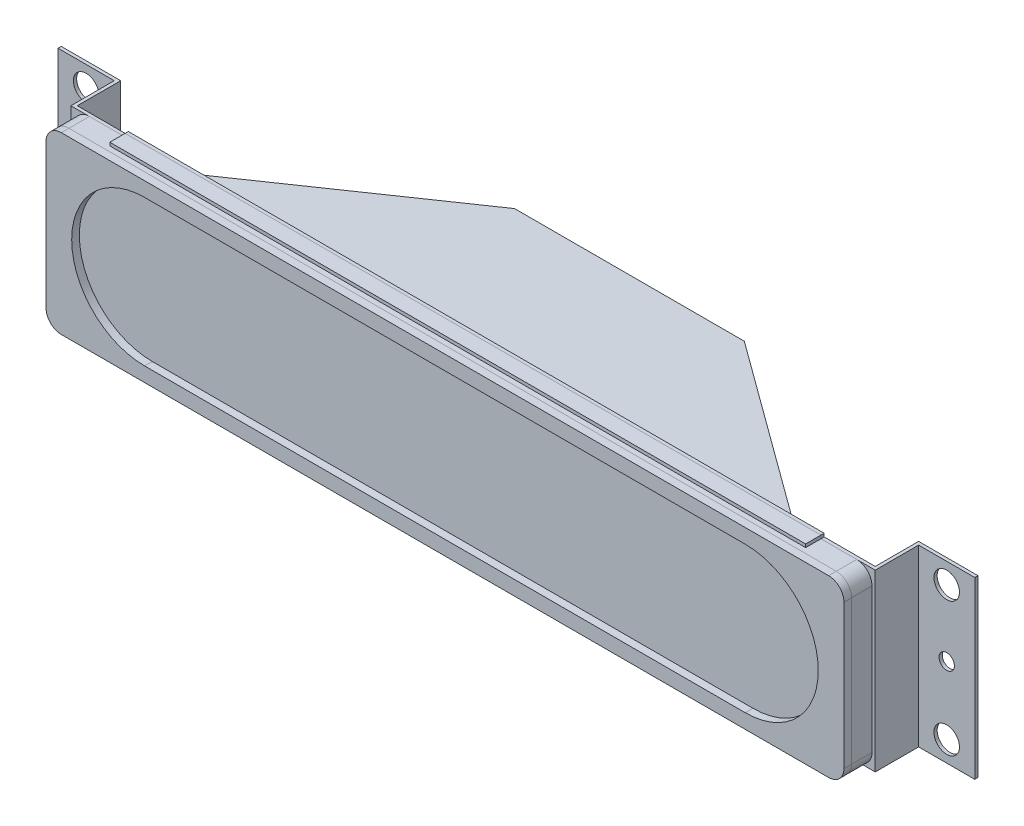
from build123d import *

# Parameters (mm, degrees)
WOOD_SURROUND_DEPTH = 4
GASKET_DEPTH        = 1.5
SPEAKER_HOLE_DEPTH  = 1.5
SKETCH4_W           = 136.28
SKETCH4_H           = 0.63
METAL_WRAP_DEPTH    = 3
METAL_WRAP_2_DEPTH  = 3
SKETCH4_4_W         = 136.28
SKETCH4_4_H         = 0.63
FRAME_DEPTH         = 0.63
SKETCH16_W          = 0.63
SKETCH16_H          = 34.24
FLANGE_DOWN_DEPTH   = 8.5
SKETCH17_W          = 0.63
SKETCH17_H          = 34.24
FLANGE_OUT_1_DEPTH  = 11
SKETCH18_W          = 0.63
SKETCH18_H          = 34.24
FLANGE_OUT_2_DEPTH  = 11
SKETCH21_R          = 2.5
SKETCH21_R_2        = 1.5
FLANGE_HOLES_DEPTH  = 6


with BuildPart() as part:
    # Sketch1 → Wood surround (new body)
    with BuildSketch(Plane.XY):
        with BuildLine():
            Line((3, 0), (153.28, 0))
            ThreePointArc((153.28, 0), (155.401320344, -0.878679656), (156.28, -3))
            Line((156.28, -3), (156.28, -31.24))
            ThreePointArc((156.28, -31.24), (155.401320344, -33.361320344), (153.28, -34.24))
            Line((153.28, -34.24), (3, -34.24))
            ThreePointArc((3, -34.24), (0.878679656, -33.361320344), (0, -31.24))
            Line((0, -31.24), (0, -3))
            ThreePointArc((0, -3), (0.878679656, -0.878679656), (3, 0))
        make_face()
    extrude(amount=WOOD_SURROUND_DEPTH)


with BuildPart() as body_2:
    # Sketch2 → Gasket (new body)
    with BuildSketch(Plane.XY.offset(4)):
        with BuildLine():
            Line((153.28, 0), (3, 0))
            ThreePointArc((3, 0), (0.878679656, -0.878679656), (0, -3))
            Line((0, -3), (0, -31.24))
            ThreePointArc((0, -31.24), (0.878679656, -33.361320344), (3, -34.24))
            Line((3, -34.24), (153.28, -34.24))
            ThreePointArc((153.28, -34.24), (155.401320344, -33.361320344), (156.28, -31.24))
            Line((156.28, -31.24), (156.28, -3))
            ThreePointArc((156.28, -3), (155.401320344, -0.878679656), (153.28, 0))
        make_face()
    extrude(amount=GASKET_DEPTH)

    # Sketch3 → Speaker Hole (cut)
    with BuildSketch(Plane.XY.offset(5.5)):
        with BuildLine():
            Line((19.32, -2.83), (136.96, -2.83))
            ThreePointArc((136.96, -2.83), (151.25, -17.12), (136.96, -31.41))
            Line((136.96, -31.41), (19.32, -31.41))
            ThreePointArc((19.32, -31.41), (5.03, -17.12), (19.32, -2.83))
        make_face()
    extrude(amount=-SPEAKER_HOLE_DEPTH, mode=Mode.SUBTRACT)


with BuildPart() as body_3:
    # Sketch4 → Metal wrap (new body)
    with BuildSketch(Plane(origin=(0, 0, 0), x_dir=(-1, 0, 0), z_dir=(0, 0, -1))):
        with Locations((-78.14, -34.555)):
            Rectangle(SKETCH4_W, SKETCH4_H)
    extrude(amount=-METAL_WRAP_DEPTH)


with BuildPart() as body_4:
    # Sketch4 → Metal wrap 2 (new body)
    with BuildSketch(Plane(origin=(0, 0, 0), x_dir=(-1, 0, 0), z_dir=(0, 0, -1))):
        with Locations((-78.14, 0.315)):
            Rectangle(SKETCH4_W, SKETCH4_H)
    extrude(amount=-METAL_WRAP_2_DEPTH)


with BuildPart() as body_5:
    # Sketch4_4 → frame (new body)
    with BuildSketch(Plane(origin=(0, 0, 0), x_dir=(-1, 0, 0), z_dir=(0, 0, -1))):
        with BuildLine():
            Line((-156.28, -17.12), (0, -17.12))
            Line((0, -17.12), (0, -3))
            ThreePointArc((0, -3), (-0.878679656, -0.878679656), (-3, 0))
            Line((-3, 0), (-10, 0))
            Line((-10, 0), (-146.28, 0))
            Line((-146.28, 0), (-153.28, 0))
            ThreePointArc((-153.28, 0), (-155.401320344, -0.878679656), (-156.28, -3))
            Line((-156.28, -3), (-156.28, -17.12))
        make_face()
        with BuildLine():
            Line((-10, -34.24), (-3, -34.24))
            ThreePointArc((-3, -34.24), (-0.878679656, -33.361320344), (0, -31.24))
            Line((0, -31.24), (0, -17.12))
            Line((0, -17.12), (-156.28, -17.12))
            Line((-156.28, -17.12), (-156.28, -31.24))
            ThreePointArc((-156.28, -31.24), (-155.401320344, -33.361320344), (-153.28, -34.24))
            Line((-153.28, -34.24), (-146.28, -34.24))
            Line((-146.28, -34.24), (-10, -34.24))
        make_face()
        Polygon((-156.28, -31.24), (-156.28, -17.12), (-156.28, -3), (-156.28, 0), (-156.91, 0), (-156.91, -34.24), (-156.28, -34.24), align=None)
        with BuildLine():
            Line((-156.28, 0), (-156.28, -3))
            ThreePointArc((-156.28, -3), (-155.401320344, -0.878679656), (-153.28, 0))
            Line((-153.28, 0), (-156.28, 0))
        make_face()
        with BuildLine():
            Line((-156.28, -34.24), (-153.28, -34.24))
            ThreePointArc((-153.28, -34.24), (-155.401320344, -33.361320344), (-156.28, -31.24))
            Line((-156.28, -31.24), (-156.28, -34.24))
        make_face()
        with BuildLine():
            Line((-3, -34.24), (0, -34.24))
            Line((0, -34.24), (0, -31.24))
            ThreePointArc((0, -31.24), (-0.878679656, -33.361320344), (-3, -34.24))
        make_face()
        Polygon((0, -34.24), (0.63, -34.24), (0.63, 0), (0, 0), (0, -3), (0, -17.12), (0, -31.24), align=None)
        with BuildLine():
            Line((0, -3), (0, 0))
            Line((0, 0), (-3, 0))
            ThreePointArc((-3, 0), (-0.878679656, -0.878679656), (0, -3))
        make_face()
        with Locations((-78.14, 0.315)):
            Rectangle(SKETCH4_4_W, SKETCH4_4_H)
        with Locations((-78.14, -34.555)):
            Rectangle(SKETCH4_4_W, SKETCH4_4_H)
    extrude(amount=FRAME_DEPTH)

    # Sketch16 → flange down (add)
    with BuildSketch(Plane(origin=(0, 0, -0.63), x_dir=(-1, 0, 0), z_dir=(0, 0, -1))):
        with Locations((-156.595, -17.12)):
            Rectangle(SKETCH16_W, SKETCH16_H)
        with Locations((0.315, -17.12)):
            Rectangle(SKETCH16_W, SKETCH16_H)
    extrude(amount=FLANGE_DOWN_DEPTH)

    # Sketch17 → flange out 1 (add)
    with BuildSketch(Plane.ZY.offset(0.63)):
        with Locations((-8.815, -17.12)):
            Rectangle(SKETCH17_W, SKETCH17_H)
    extrude(amount=FLANGE_OUT_1_DEPTH)

    # Sketch18 → flange out 2 (add)
    with BuildSketch(Plane(origin=(156.91, 0, 0), x_dir=(0, 0, -1), z_dir=(1, 0, 0))):
        with Locations((8.815, -17.12)):
            Rectangle(SKETCH18_W, SKETCH18_H)
    extrude(amount=FLANGE_OUT_2_DEPTH)

    # Sketch20 → Loft1 section 0
    with BuildSketch(Plane(origin=(0, 0, -0.63), x_dir=(-1, 0, 0), z_dir=(0, 0, -1))):
        with BuildLine():
            Line((-141.28, -30.87), (-15, -30.87))
            Line((-15, -30.87), (-15, -3.37))
            Line((-15, -3.37), (-141.28, -3.37))
            Line((-141.28, -3.37), (-141.28, -30.87))
        make_face()
    # Sketch19 → Loft1 section 1
    with BuildSketch(Plane(origin=(0, 0, -30.63), x_dir=(-1, 0, 0), z_dir=(0, 0, -1))):
        with BuildLine():
            Line((-100.64, -29.62), (-55.64, -29.62))
            Line((-55.64, -29.62), (-55.64, -4.62))
            Line((-55.64, -4.62), (-100.64, -4.62))
            Line((-100.64, -4.62), (-100.64, -29.62))
        make_face()
    loft()

    # Sketch21 → flange holes (cut)
    with BuildSketch(Plane(origin=(0, 0, -9.13), x_dir=(-1, 0, 0), z_dir=(0, 0, -1))):
        with Locations((-162.41, -4)):
            Circle(SKETCH21_R)
        with Locations((-162.41, -17)):
            Circle(SKETCH21_R_2)
        with Locations((-162.41, -30.24)):
            Circle(SKETCH21_R)
    flange_holes = extrude(amount=-FLANGE_HOLES_DEPTH, mode=Mode.SUBTRACT)

    # Mirror1: flange holes across plane
    add(flange_holes.mirror(Plane(origin=(78.14, 0, 0), x_dir=(0, 0, 1), z_dir=(1, 0, 0))), mode=Mode.SUBTRACT)


solid = Compound([part.part, body_2.part, body_3.part, body_4.part, body_5.part])
